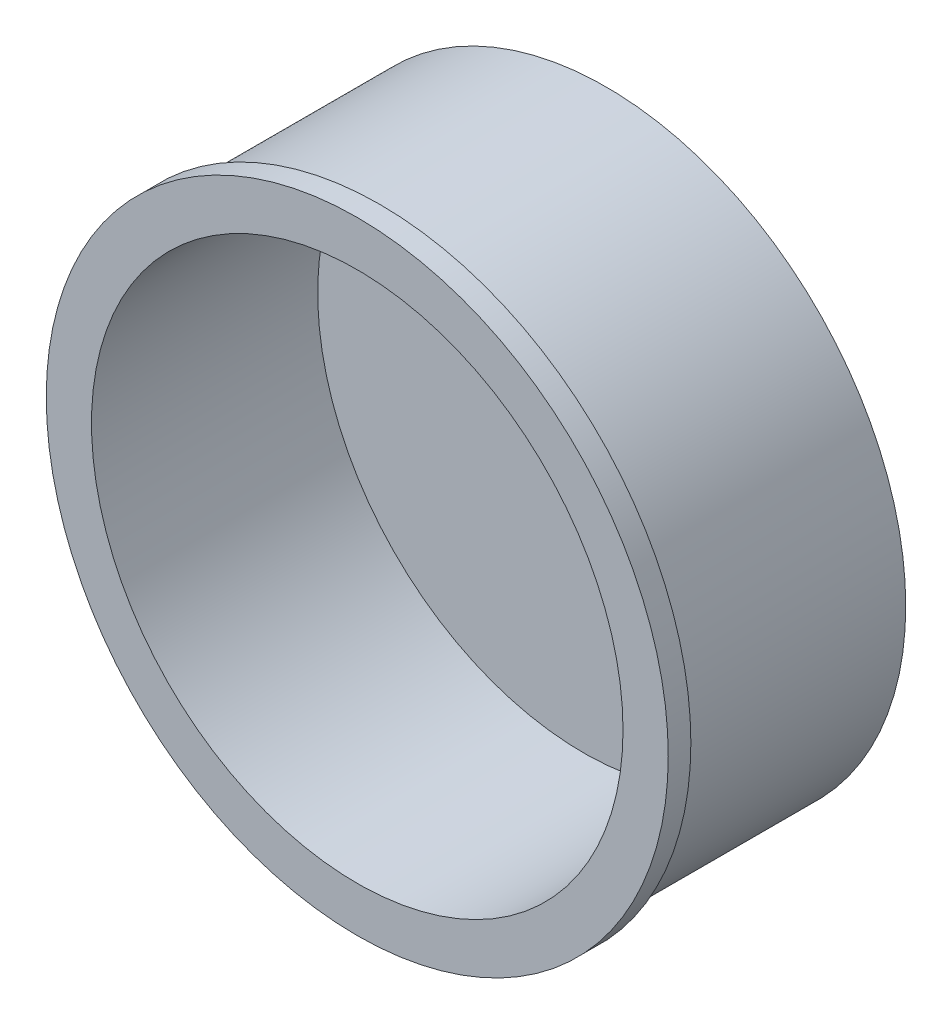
from build123d import *


with BuildPart() as part:
    # Esquisse2 → R_volution1 (revolve)
    with BuildSketch(Plane(origin=(0, 246.033655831, 0), x_dir=(-1, 0, 0), z_dir=(0, 1, 0)), mode=Mode.PRIVATE) as r_volution1_sk:
        Polygon((36.744, 1), (34.744, 1), (34.744, -9), (22.994, -9), (22.994, -10), (36.244, -10), (36.244, 0), (36.744, 0), align=None)
    revolve(r_volution1_sk.sketch.rotate(Axis((-22.994, 246.033655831, 0), (0, 0, -1)), 180), axis=Axis((-22.994, 246.033655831, 0), (0, 0, -1)))


solid = part.part
